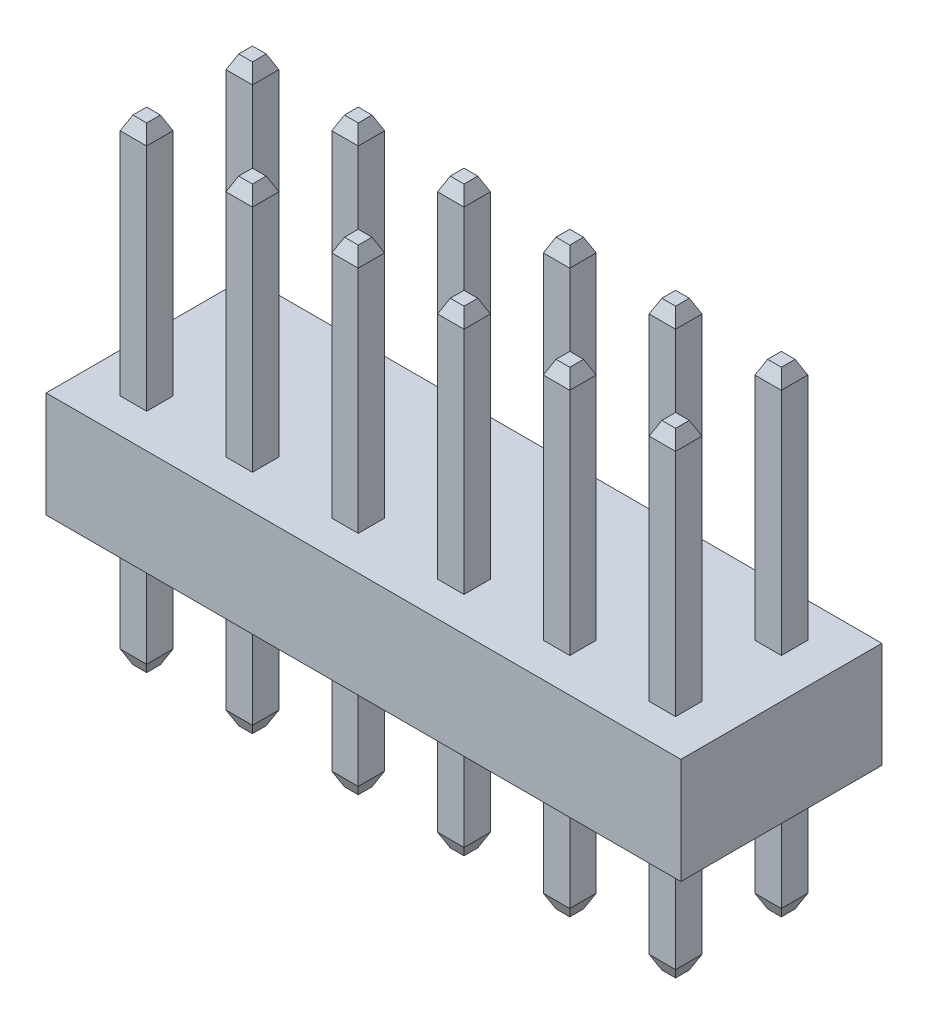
from build123d import *

# Parameters (mm, degrees)
SKETCH1_W           = 15.24
SKETCH1_H           = 4.826
BOSS_EXTRUDE2_DEPTH = 2.54
SKETCH2_W           = 0.635
SKETCH2_H           = 0.635
BOSS_EXTRUDE3_DEPTH = 5.5151782
SKETCH1_5_W         = 0.635
SKETCH1_5_H         = 0.635
BOSS_EXTRUDE5_DEPTH = 2.7211782


with BuildPart() as part:
    # Sketch1 → Boss-Extrude2 (new body)
    with BuildSketch(Plane(origin=(0, 0, 0), x_dir=(1, 0, 0), z_dir=(0, 1, 0))):
        Rectangle(SKETCH1_W, SKETCH1_H)
    extrude(amount=BOSS_EXTRUDE2_DEPTH)

    # Sketch2 → Boss-Extrude3 (add)
    with BuildSketch(Plane(origin=(0, 2.54, 0), x_dir=(1, 0, 0), z_dir=(0, 1, 0))):
        with Locations((-6.35, 1.27)):
            Rectangle(SKETCH2_W, SKETCH2_H)
        with Locations((-3.81, 1.27)):
            Rectangle(SKETCH2_W, SKETCH2_H)
        with Locations((-1.27, 1.27)):
            Rectangle(SKETCH2_W, SKETCH2_H)
        with Locations((1.27, 1.27)):
            Rectangle(SKETCH2_W, SKETCH2_H)
        with Locations((3.81, 1.27)):
            Rectangle(SKETCH2_W, SKETCH2_H)
        with Locations((6.35, 1.27)):
            Rectangle(SKETCH2_W, SKETCH2_H)
        with Locations((-3.81, -1.27)):
            Rectangle(SKETCH2_W, SKETCH2_H)
        with Locations((-1.27, -1.27)):
            Rectangle(SKETCH2_W, SKETCH2_H)
        with Locations((1.27, -1.27)):
            Rectangle(SKETCH2_W, SKETCH2_H)
        with Locations((3.81, -1.27)):
            Rectangle(SKETCH2_W, SKETCH2_H)
        with Locations((6.35, -1.27)):
            Rectangle(SKETCH2_W, SKETCH2_H)
        with Locations((-6.35, -1.27)):
            Rectangle(SKETCH2_W, SKETCH2_H)
    extrude(amount=BOSS_EXTRUDE3_DEPTH)

    # Sketch6 → section 1 of loft1
    with BuildSketch(Plane(origin=(0, 8.382, 0), x_dir=(1, 0, 0), z_dir=(0, 1, 0)), mode=Mode.PRIVATE) as loft1_s1:
        with BuildLine():
            Line((-6.5151, 1.4351), (-6.1849, 1.4351))
            Line((-6.1849, 1.4351), (-6.1849, 1.1049))
            Line((-6.1849, 1.1049), (-6.5151, 1.1049))
            Line((-6.5151, 1.1049), (-6.5151, 1.4351))
        make_face()
    # loft from a face of the part (loft1)
    loft([part.faces().sort_by_distance((-6.35, 8.0551782, -1.27))[0], loft1_s1.sketch])

    # Sketch6_5 → section 1 of loft3
    with BuildSketch(Plane(origin=(0, 8.382, 0), x_dir=(1, 0, 0), z_dir=(0, 1, 0)), mode=Mode.PRIVATE) as loft3_s1:
        with BuildLine():
            Line((-3.9751, 1.4351), (-3.9751, 1.1049))
            Line((-3.9751, 1.1049), (-3.6449, 1.1049))
            Line((-3.6449, 1.1049), (-3.6449, 1.4351))
            Line((-3.6449, 1.4351), (-3.9751, 1.4351))
        make_face()
    # loft from a face of the part (loft3)
    loft([part.faces().sort_by_distance((-3.81, 8.0551782, -1.27))[0], loft3_s1.sketch])

    # Sketch6_6 → section 1 of loft4
    with BuildSketch(Plane(origin=(0, 8.382, 0), x_dir=(1, 0, 0), z_dir=(0, 1, 0)), mode=Mode.PRIVATE) as loft4_s1:
        with BuildLine():
            Line((-1.4351, 1.4351), (-1.4351, 1.1049))
            Line((-1.4351, 1.1049), (-1.1049, 1.1049))
            Line((-1.1049, 1.1049), (-1.1049, 1.4351))
            Line((-1.1049, 1.4351), (-1.4351, 1.4351))
        make_face()
    # loft from a face of the part (loft4)
    loft([part.faces().sort_by_distance((-1.27, 8.0551782, -1.27))[0], loft4_s1.sketch])

    # Sketch6_7 → section 1 of loft5
    with BuildSketch(Plane(origin=(0, 8.382, 0), x_dir=(1, 0, 0), z_dir=(0, 1, 0)), mode=Mode.PRIVATE) as loft5_s1:
        with BuildLine():
            Line((1.1049, 1.4351), (1.1049, 1.1049))
            Line((1.1049, 1.1049), (1.4351, 1.1049))
            Line((1.4351, 1.1049), (1.4351, 1.4351))
            Line((1.4351, 1.4351), (1.1049, 1.4351))
        make_face()
    # loft from a face of the part (loft5)
    loft([part.faces().sort_by_distance((1.27, 8.0551782, -1.27))[0], loft5_s1.sketch])

    # Sketch6_8 → section 1 of loft6
    with BuildSketch(Plane(origin=(0, 8.382, 0), x_dir=(1, 0, 0), z_dir=(0, 1, 0)), mode=Mode.PRIVATE) as loft6_s1:
        with BuildLine():
            Line((3.6449, 1.4351), (3.6449, 1.1049))
            Line((3.6449, 1.1049), (3.9751, 1.1049))
            Line((3.9751, 1.1049), (3.9751, 1.4351))
            Line((3.9751, 1.4351), (3.6449, 1.4351))
        make_face()
    # loft from a face of the part (loft6)
    loft([part.faces().sort_by_distance((3.81, 8.0551782, -1.27))[0], loft6_s1.sketch])

    # Sketch6_9 → section 1 of loft7
    with BuildSketch(Plane(origin=(0, 8.382, 0), x_dir=(1, 0, 0), z_dir=(0, 1, 0)), mode=Mode.PRIVATE) as loft7_s1:
        with BuildLine():
            Line((6.1849, 1.4351), (6.1849, 1.1049))
            Line((6.1849, 1.1049), (6.5151, 1.1049))
            Line((6.5151, 1.1049), (6.5151, 1.4351))
            Line((6.5151, 1.4351), (6.1849, 1.4351))
        make_face()
    # loft from a face of the part (loft7)
    loft([part.faces().sort_by_distance((6.35, 8.0551782, -1.27))[0], loft7_s1.sketch])

    # Sketch6_10 → section 1 of loft8
    with BuildSketch(Plane(origin=(0, 8.382, 0), x_dir=(1, 0, 0), z_dir=(0, 1, 0)), mode=Mode.PRIVATE) as loft8_s1:
        with BuildLine():
            Line((-6.5151, -1.1049), (-6.5151, -1.4351))
            Line((-6.5151, -1.4351), (-6.1849, -1.4351))
            Line((-6.1849, -1.4351), (-6.1849, -1.1049))
            Line((-6.1849, -1.1049), (-6.5151, -1.1049))
        make_face()
    # loft from a face of the part (loft8)
    loft([part.faces().sort_by_distance((-6.35, 8.0551782, 1.27))[0], loft8_s1.sketch])

    # Sketch6_11 → section 1 of loft9
    with BuildSketch(Plane(origin=(0, 8.382, 0), x_dir=(1, 0, 0), z_dir=(0, 1, 0)), mode=Mode.PRIVATE) as loft9_s1:
        with BuildLine():
            Line((-3.9751, -1.1049), (-3.9751, -1.4351))
            Line((-3.9751, -1.4351), (-3.6449, -1.4351))
            Line((-3.6449, -1.4351), (-3.6449, -1.1049))
            Line((-3.6449, -1.1049), (-3.9751, -1.1049))
        make_face()
    # loft from a face of the part (loft9)
    loft([part.faces().sort_by_distance((-3.81, 8.0551782, 1.27))[0], loft9_s1.sketch])

    # Sketch6_12 → section 1 of loft10
    with BuildSketch(Plane(origin=(0, 8.382, 0), x_dir=(1, 0, 0), z_dir=(0, 1, 0)), mode=Mode.PRIVATE) as loft10_s1:
        with BuildLine():
            Line((-1.4351, -1.1049), (-1.4351, -1.4351))
            Line((-1.4351, -1.4351), (-1.1049, -1.4351))
            Line((-1.1049, -1.4351), (-1.1049, -1.1049))
            Line((-1.1049, -1.1049), (-1.4351, -1.1049))
        make_face()
    # loft from a face of the part (loft10)
    loft([part.faces().sort_by_distance((-1.27, 8.0551782, 1.27))[0], loft10_s1.sketch])

    # Sketch6_13 → section 1 of loft11
    with BuildSketch(Plane(origin=(0, 8.382, 0), x_dir=(1, 0, 0), z_dir=(0, 1, 0)), mode=Mode.PRIVATE) as loft11_s1:
        with BuildLine():
            Line((1.1049, -1.1049), (1.1049, -1.4351))
            Line((1.1049, -1.4351), (1.4351, -1.4351))
            Line((1.4351, -1.4351), (1.4351, -1.1049))
            Line((1.4351, -1.1049), (1.1049, -1.1049))
        make_face()
    # loft from a face of the part (loft11)
    loft([part.faces().sort_by_distance((1.27, 8.0551782, 1.27))[0], loft11_s1.sketch])

    # Sketch6_14 → section 1 of loft12
    with BuildSketch(Plane(origin=(0, 8.382, 0), x_dir=(1, 0, 0), z_dir=(0, 1, 0)), mode=Mode.PRIVATE) as loft12_s1:
        with BuildLine():
            Line((3.6449, -1.1049), (3.6449, -1.4351))
            Line((3.6449, -1.4351), (3.9751, -1.4351))
            Line((3.9751, -1.4351), (3.9751, -1.1049))
            Line((3.9751, -1.1049), (3.6449, -1.1049))
        make_face()
    # loft from a face of the part (loft12)
    loft([part.faces().sort_by_distance((3.81, 8.0551782, 1.27))[0], loft12_s1.sketch])

    # Sketch6_15 → section 1 of loft13
    with BuildSketch(Plane(origin=(0, 8.382, 0), x_dir=(1, 0, 0), z_dir=(0, 1, 0)), mode=Mode.PRIVATE) as loft13_s1:
        with BuildLine():
            Line((6.1849, -1.1049), (6.1849, -1.4351))
            Line((6.1849, -1.4351), (6.5151, -1.4351))
            Line((6.5151, -1.4351), (6.5151, -1.1049))
            Line((6.5151, -1.1049), (6.1849, -1.1049))
        make_face()
    # loft from a face of the part (loft13)
    loft([part.faces().sort_by_distance((6.35, 8.0551782, 1.27))[0], loft13_s1.sketch])

    # Sketch1_5 → Boss-Extrude5 (add)
    with BuildSketch(Plane(origin=(0, 0, 0), x_dir=(1, 0, 0), z_dir=(0, 1, 0))):
        with Locations((-6.35, -1.27)):
            Rectangle(SKETCH1_5_W, SKETCH1_5_H)
        with Locations((-3.81, -1.27)):
            Rectangle(SKETCH1_5_W, SKETCH1_5_H)
        with Locations((-1.27, -1.27)):
            Rectangle(SKETCH1_5_W, SKETCH1_5_H)
        with Locations((1.27, -1.27)):
            Rectangle(SKETCH1_5_W, SKETCH1_5_H)
        with Locations((3.81, -1.27)):
            Rectangle(SKETCH1_5_W, SKETCH1_5_H)
        with Locations((6.35, -1.27)):
            Rectangle(SKETCH1_5_W, SKETCH1_5_H)
        with Locations((6.35, 1.27)):
            Rectangle(SKETCH1_5_W, SKETCH1_5_H)
        with Locations((3.81, 1.27)):
            Rectangle(SKETCH1_5_W, SKETCH1_5_H)
        with Locations((1.27, 1.27)):
            Rectangle(SKETCH1_5_W, SKETCH1_5_H)
        with Locations((-6.35, 1.27)):
            Rectangle(SKETCH1_5_W, SKETCH1_5_H)
        with Locations((-3.81, 1.27)):
            Rectangle(SKETCH1_5_W, SKETCH1_5_H)
        with Locations((-1.27, 1.27)):
            Rectangle(SKETCH1_5_W, SKETCH1_5_H)
    extrude(amount=-BOSS_EXTRUDE5_DEPTH)

    # Sketch9 → section 1 of loft14
    with BuildSketch(Plane(origin=(0, -3.048, 0), x_dir=(-1, 0, 0), z_dir=(0, -1, 0)), mode=Mode.PRIVATE) as loft14_s1:
        with BuildLine():
            Line((-6.5151, 1.4351), (-6.1849, 1.4351))
            Line((-6.1849, 1.4351), (-6.1849, 1.1049))
            Line((-6.1849, 1.1049), (-6.5151, 1.1049))
            Line((-6.5151, 1.1049), (-6.5151, 1.4351))
        make_face()
    # loft from a face of the part (loft14)
    loft([part.faces().sort_by_distance((6.35, -2.7211782, -1.27))[0], loft14_s1.sketch])

    # Sketch9_3 → section 1 of loft15
    with BuildSketch(Plane(origin=(0, -3.048, 0), x_dir=(-1, 0, 0), z_dir=(0, -1, 0)), mode=Mode.PRIVATE) as loft15_s1:
        with BuildLine():
            Line((-3.9751, 1.4351), (-3.9751, 1.1049))
            Line((-3.9751, 1.1049), (-3.6449, 1.1049))
            Line((-3.6449, 1.1049), (-3.6449, 1.4351))
            Line((-3.6449, 1.4351), (-3.9751, 1.4351))
        make_face()
    # loft from a face of the part (loft15)
    loft([part.faces().sort_by_distance((3.81, -2.7211782, -1.27))[0], loft15_s1.sketch])

    # Sketch9_4 → section 1 of loft16
    with BuildSketch(Plane(origin=(0, -3.048, 0), x_dir=(-1, 0, 0), z_dir=(0, -1, 0)), mode=Mode.PRIVATE) as loft16_s1:
        with BuildLine():
            Line((-1.4351, 1.4351), (-1.4351, 1.1049))
            Line((-1.4351, 1.1049), (-1.1049, 1.1049))
            Line((-1.1049, 1.1049), (-1.1049, 1.4351))
            Line((-1.1049, 1.4351), (-1.4351, 1.4351))
        make_face()
    # loft from a face of the part (loft16)
    loft([part.faces().sort_by_distance((1.27, -2.7211782, -1.27))[0], loft16_s1.sketch])

    # Sketch9_5 → section 1 of loft17
    with BuildSketch(Plane(origin=(0, -3.048, 0), x_dir=(-1, 0, 0), z_dir=(0, -1, 0)), mode=Mode.PRIVATE) as loft17_s1:
        with BuildLine():
            Line((1.1049, 1.4351), (1.1049, 1.1049))
            Line((1.1049, 1.1049), (1.4351, 1.1049))
            Line((1.4351, 1.1049), (1.4351, 1.4351))
            Line((1.4351, 1.4351), (1.1049, 1.4351))
        make_face()
    # loft from a face of the part (loft17)
    loft([part.faces().sort_by_distance((-1.27, -2.7211782, -1.27))[0], loft17_s1.sketch])

    # Sketch9_6 → section 1 of loft18
    with BuildSketch(Plane(origin=(0, -3.048, 0), x_dir=(-1, 0, 0), z_dir=(0, -1, 0)), mode=Mode.PRIVATE) as loft18_s1:
        with BuildLine():
            Line((3.6449, 1.4351), (3.6449, 1.1049))
            Line((3.6449, 1.1049), (3.9751, 1.1049))
            Line((3.9751, 1.1049), (3.9751, 1.4351))
            Line((3.9751, 1.4351), (3.6449, 1.4351))
        make_face()
    # loft from a face of the part (loft18)
    loft([part.faces().sort_by_distance((-3.81, -2.7211782, -1.27))[0], loft18_s1.sketch])

    # Sketch9_7 → section 1 of loft19
    with BuildSketch(Plane(origin=(0, -3.048, 0), x_dir=(-1, 0, 0), z_dir=(0, -1, 0)), mode=Mode.PRIVATE) as loft19_s1:
        with BuildLine():
            Line((6.1849, 1.4351), (6.1849, 1.1049))
            Line((6.1849, 1.1049), (6.5151, 1.1049))
            Line((6.5151, 1.1049), (6.5151, 1.4351))
            Line((6.5151, 1.4351), (6.1849, 1.4351))
        make_face()
    # loft from a face of the part (loft19)
    loft([part.faces().sort_by_distance((-6.35, -2.7211782, -1.27))[0], loft19_s1.sketch])

    # Sketch9_8 → section 1 of loft20
    with BuildSketch(Plane(origin=(0, -3.048, 0), x_dir=(-1, 0, 0), z_dir=(0, -1, 0)), mode=Mode.PRIVATE) as loft20_s1:
        with BuildLine():
            Line((-6.5151, -1.1049), (-6.5151, -1.4351))
            Line((-6.5151, -1.4351), (-6.1849, -1.4351))
            Line((-6.1849, -1.4351), (-6.1849, -1.1049))
            Line((-6.1849, -1.1049), (-6.5151, -1.1049))
        make_face()
    # loft from a face of the part (loft20)
    loft([part.faces().sort_by_distance((6.35, -2.7211782, 1.27))[0], loft20_s1.sketch])

    # Sketch9_9 → section 1 of loft21
    with BuildSketch(Plane(origin=(0, -3.048, 0), x_dir=(-1, 0, 0), z_dir=(0, -1, 0)), mode=Mode.PRIVATE) as loft21_s1:
        with BuildLine():
            Line((-3.9751, -1.1049), (-3.9751, -1.4351))
            Line((-3.9751, -1.4351), (-3.6449, -1.4351))
            Line((-3.6449, -1.4351), (-3.6449, -1.1049))
            Line((-3.6449, -1.1049), (-3.9751, -1.1049))
        make_face()
    # loft from a face of the part (loft21)
    loft([part.faces().sort_by_distance((3.81, -2.7211782, 1.27))[0], loft21_s1.sketch])

    # Sketch9_10 → section 1 of loft22
    with BuildSketch(Plane(origin=(0, -3.048, 0), x_dir=(-1, 0, 0), z_dir=(0, -1, 0)), mode=Mode.PRIVATE) as loft22_s1:
        with BuildLine():
            Line((-1.4351, -1.1049), (-1.4351, -1.4351))
            Line((-1.4351, -1.4351), (-1.1049, -1.4351))
            Line((-1.1049, -1.4351), (-1.1049, -1.1049))
            Line((-1.1049, -1.1049), (-1.4351, -1.1049))
        make_face()
    # loft from a face of the part (loft22)
    loft([part.faces().sort_by_distance((1.27, -2.7211782, 1.27))[0], loft22_s1.sketch])

    # Sketch9_11 → section 1 of loft23
    with BuildSketch(Plane(origin=(0, -3.048, 0), x_dir=(-1, 0, 0), z_dir=(0, -1, 0)), mode=Mode.PRIVATE) as loft23_s1:
        with BuildLine():
            Line((1.1049, -1.1049), (1.1049, -1.4351))
            Line((1.1049, -1.4351), (1.4351, -1.4351))
            Line((1.4351, -1.4351), (1.4351, -1.1049))
            Line((1.4351, -1.1049), (1.1049, -1.1049))
        make_face()
    # loft from a face of the part (loft23)
    loft([part.faces().sort_by_distance((-1.27, -2.7211782, 1.27))[0], loft23_s1.sketch])

    # Sketch9_12 → section 1 of loft24
    with BuildSketch(Plane(origin=(0, -3.048, 0), x_dir=(-1, 0, 0), z_dir=(0, -1, 0)), mode=Mode.PRIVATE) as loft24_s1:
        with BuildLine():
            Line((3.6449, -1.1049), (3.6449, -1.4351))
            Line((3.6449, -1.4351), (3.9751, -1.4351))
            Line((3.9751, -1.4351), (3.9751, -1.1049))
            Line((3.9751, -1.1049), (3.6449, -1.1049))
        make_face()
    # loft from a face of the part (loft24)
    loft([part.faces().sort_by_distance((-3.81, -2.7211782, 1.27))[0], loft24_s1.sketch])

    # Sketch9_13 → section 1 of loft25
    with BuildSketch(Plane(origin=(0, -3.048, 0), x_dir=(-1, 0, 0), z_dir=(0, -1, 0)), mode=Mode.PRIVATE) as loft25_s1:
        with BuildLine():
            Line((6.1849, -1.1049), (6.1849, -1.4351))
            Line((6.1849, -1.4351), (6.5151, -1.4351))
            Line((6.5151, -1.4351), (6.5151, -1.1049))
            Line((6.5151, -1.1049), (6.1849, -1.1049))
        make_face()
    # loft from a face of the part (loft25)
    loft([part.faces().sort_by_distance((-6.35, -2.7211782, 1.27))[0], loft25_s1.sketch])


solid = part.part
